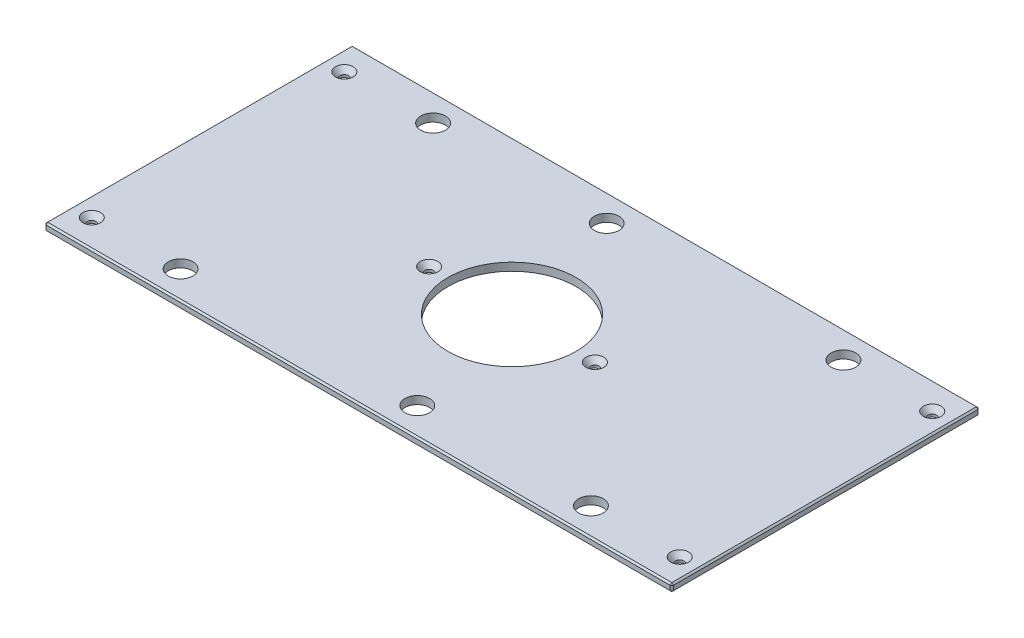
from build123d import *

# Parameters (mm, degrees)
SKETCH1_W                                     = 504.825
SKETCH1_H                                     = 247.65
BOSS_EXTRUDE1_DEPTH                           = 6.35
SKETCH13_R                                    = 51.562
CUT_EXTRUDE6_DEPTH                            = 282.220595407
F_25_32_0_78125_DIAMETER_HOLE1_D              = 19.84375
CHAMFER2_SIZE                                 = 1.27
CSK_FOR_1_4_FLAT_HEAD_MACHINE_SCREW1_AT_COUNT = 2
CSK_FOR_1_4_FLAT_HEAD_MACHINE_SCREW1_AT_PITCH = 203.2
CSK_FOR_1_4_FLAT_HEAD_MACHINE_SCREW1_2_COUNT  = 2
CSK_FOR_1_4_FLAT_HEAD_MACHINE_SCREW1_2_PITCH  = 514.869105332
CSK_FOR_1_4_FLAT_HEAD_MACHINE_SCREW1_3_COUNT  = 2
CSK_FOR_1_4_FLAT_HEAD_MACHINE_SCREW1_3_PITCH  = 319.781769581
CSK_FOR_1_4_FLAT_HEAD_MACHINE_SCREW1_4_COUNT  = 2
CSK_FOR_1_4_FLAT_HEAD_MACHINE_SCREW1_4_PITCH  = 197.92884809
CSK_FOR_1_4_FLAT_HEAD_MACHINE_SCREW1_5_COUNT  = 2
CSK_FOR_1_4_FLAT_HEAD_MACHINE_SCREW1_5_PITCH  = 473.075
CSK_FOR_1_4_FLAT_HEAD_MACHINE_SCREW1_6_COUNT  = 2
CSK_FOR_1_4_FLAT_HEAD_MACHINE_SCREW1_6_PITCH  = 401.6375
CSK_FOR_1_4_FLAT_HEAD_MACHINE_SCREW1_7_COUNT  = 2
CSK_FOR_1_4_FLAT_HEAD_MACHINE_SCREW1_7_PITCH  = 450.114342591


with BuildPart() as part:
    # Sketch1 → Boss-Extrude1 (new body)
    with BuildSketch(Plane(origin=(0, 0, 0), x_dir=(1, 0, 0), z_dir=(0, 1, 0))):
        Rectangle(SKETCH1_W, SKETCH1_H)
    extrude(amount=BOSS_EXTRUDE1_DEPTH)

    # Sketch13 → Cut-Extrude6 (cut, through all)
    with BuildSketch(Plane(origin=(0, 6.35, 0), x_dir=(1, 0, 0), z_dir=(0, 1, 0))):
        with Locations(Location((0, 0, 0), (0, 0, 270))):
            Circle(SKETCH13_R)
    extrude(amount=-CUT_EXTRUDE6_DEPTH, mode=Mode.SUBTRACT)

    # 25_32 _0.78125_ Diameter Hole1 (through all)
    with Locations(Plane(origin=(0, 6.35, 0), x_dir=(1, 0, 0), z_dir=(0, 1, 0))):
        with Locations((165.1, 101.6), (-165.1, 101.6), (165.1, -101.6), (-165.1, -101.6), (-25.4, 101.6), (25.4, -101.6)):
            Hole(F_25_32_0_78125_DIAMETER_HOLE1_D / 2)

    # Chamfer2
    chamfer2_edges = [part.edges().sort_by_distance(p)[0] for p in [
        (252.4125, 6.35, 0),
        (0, 6.35, -123.825),
        (-252.4125, 6.35, 0),
        (0, 0, -123.825),
        (252.4125, 0, 0),
        (0, 0, 123.825),
        (-252.4125, 0, 0),
        (0, 6.35, 123.825),
        (-252.4125, 3.175, -123.825),
        (252.4125, 3.175, -123.825),
        (252.4125, 3.175, 123.825),
        (-252.4125, 3.175, 123.825),
    ]]
    chamfer(chamfer2_edges, length=CHAMFER2_SIZE)

    # Sketch24 → CSK for 1_4 Flat Head Machine Screw1 (revolve, cut)
    with BuildSketch(Plane(origin=(236.5375, 6.35, -101.6), x_dir=(0, 0, 1), z_dir=(1, 0, 0))):
        Polygon((0, 0), (0, 6.35), (3.3782, 6.35), (3.3782, 4.324464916), (7.1374, 0), align=None)
    csk_for_1_4_flat_head_machine_screw1 = revolve(axis=Axis((236.5375, 12.7, -101.6), (0, -1, 0)), mode=Mode.SUBTRACT)

    # CSK for 1_4 Flat Head Machine Screw1 at: CSK for 1_4 Flat Head Machine Screw1 ×2
    with Locations(*[(0, 0, i * CSK_FOR_1_4_FLAT_HEAD_MACHINE_SCREW1_AT_PITCH) for i in range(1, CSK_FOR_1_4_FLAT_HEAD_MACHINE_SCREW1_AT_COUNT)]):
        add(csk_for_1_4_flat_head_machine_screw1, mode=Mode.SUBTRACT)

    # CSK for 1_4 Flat Head Machine Screw1 2: CSK for 1_4 Flat Head Machine Screw1 ×2
    with Locations(*[Vector(-0.9188257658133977, 0, 0.39466341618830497) * (i * CSK_FOR_1_4_FLAT_HEAD_MACHINE_SCREW1_2_PITCH) for i in range(1, CSK_FOR_1_4_FLAT_HEAD_MACHINE_SCREW1_2_COUNT)]):
        add(csk_for_1_4_flat_head_machine_screw1, mode=Mode.SUBTRACT)

    # CSK for 1_4 Flat Head Machine Screw1 3: CSK for 1_4 Flat Head Machine Screw1 ×2
    with Locations(*[Vector(-0.9481856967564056, 0, 0.31771667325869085) * (i * CSK_FOR_1_4_FLAT_HEAD_MACHINE_SCREW1_3_PITCH) for i in range(1, CSK_FOR_1_4_FLAT_HEAD_MACHINE_SCREW1_3_COUNT)]):
        add(csk_for_1_4_flat_head_machine_screw1, mode=Mode.SUBTRACT)

    # CSK for 1_4 Flat Head Machine Screw1 4: CSK for 1_4 Flat Head Machine Screw1 ×2
    with Locations(*[Vector(-0.8581998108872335, 0, 0.513315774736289) * (i * CSK_FOR_1_4_FLAT_HEAD_MACHINE_SCREW1_4_PITCH) for i in range(1, CSK_FOR_1_4_FLAT_HEAD_MACHINE_SCREW1_4_COUNT)]):
        add(csk_for_1_4_flat_head_machine_screw1, mode=Mode.SUBTRACT)

    # CSK for 1_4 Flat Head Machine Screw1 5: CSK for 1_4 Flat Head Machine Screw1 ×2
    with Locations(*[(-i * CSK_FOR_1_4_FLAT_HEAD_MACHINE_SCREW1_5_PITCH, 0, 0) for i in range(1, CSK_FOR_1_4_FLAT_HEAD_MACHINE_SCREW1_5_COUNT)]):
        add(csk_for_1_4_flat_head_machine_screw1, mode=Mode.SUBTRACT)

    # CSK for 1_4 Flat Head Machine Screw1 6: CSK for 1_4 Flat Head Machine Screw1 ×2
    with Locations(*[(-i * CSK_FOR_1_4_FLAT_HEAD_MACHINE_SCREW1_6_PITCH, 0, 0) for i in range(1, CSK_FOR_1_4_FLAT_HEAD_MACHINE_SCREW1_6_COUNT)]):
        add(csk_for_1_4_flat_head_machine_screw1, mode=Mode.SUBTRACT)

    # CSK for 1_4 Flat Head Machine Screw1 7: CSK for 1_4 Flat Head Machine Screw1 ×2
    with Locations(*[Vector(-0.8923010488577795, 0, 0.45144084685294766) * (i * CSK_FOR_1_4_FLAT_HEAD_MACHINE_SCREW1_7_PITCH) for i in range(1, CSK_FOR_1_4_FLAT_HEAD_MACHINE_SCREW1_7_COUNT)]):
        add(csk_for_1_4_flat_head_machine_screw1, mode=Mode.SUBTRACT)


solid = part.part
